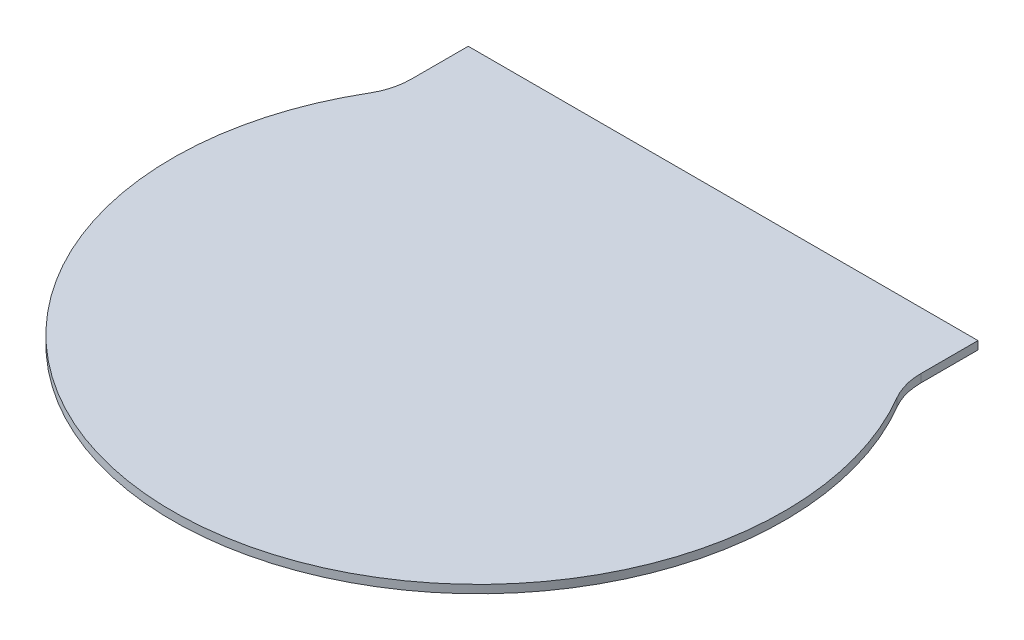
ISO-10303-21;
HEADER;
FILE_DESCRIPTION(('STEP AP214'),'2;1');
FILE_NAME('part.step','',(''),(''),'','','');
FILE_SCHEMA(('AUTOMOTIVE_DESIGN { 1 0 10303 214 1 1 1 1 }'));
ENDSEC;
DATA;
#1=APPLICATION_CONTEXT('core data for automotive mechanical design processes');
#2=APPLICATION_PROTOCOL_DEFINITION('international standard','automotive_design',2000,#1);
#3=PRODUCT_CONTEXT('',#1,'mechanical');
#4=PRODUCT('Part','Part','',(#3));
#5=PRODUCT_RELATED_PRODUCT_CATEGORY('part','',(#4));
#6=PRODUCT_DEFINITION_FORMATION('','',#4);
#7=PRODUCT_DEFINITION_CONTEXT('part definition',#1,'design');
#8=PRODUCT_DEFINITION('design','',#6,#7);
#9=PRODUCT_DEFINITION_SHAPE('','',#8);
#10=(LENGTH_UNIT() NAMED_UNIT(*) SI_UNIT(.MILLI.,.METRE.));
#11=(NAMED_UNIT(*) PLANE_ANGLE_UNIT() SI_UNIT($,.RADIAN.));
#12=(NAMED_UNIT(*) SI_UNIT($,.STERADIAN.) SOLID_ANGLE_UNIT());
#13=UNCERTAINTY_MEASURE_WITH_UNIT(LENGTH_MEASURE(1.E-05),#10,'distance_accuracy_value','');
#14=(GEOMETRIC_REPRESENTATION_CONTEXT(3) GLOBAL_UNCERTAINTY_ASSIGNED_CONTEXT((#13)) GLOBAL_UNIT_ASSIGNED_CONTEXT((#10,
#11,#12)) REPRESENTATION_CONTEXT('',''));
#15=CARTESIAN_POINT('',(0.,0.,0.));
#16=DIRECTION('',(0.,0.,1.));
#17=DIRECTION('',(1.,0.,0.));
#18=AXIS2_PLACEMENT_3D('',#15,#16,#17);
#19=CARTESIAN_POINT('',(3.98779999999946,0.1016,-2.33831798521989));
#20=DIRECTION('',(0.,-1.,0.));
#21=DIRECTION('',(0.,0.,-1.));
#22=AXIS2_PLACEMENT_3D('',#19,#20,#21);
#23=CYLINDRICAL_SURFACE('',#22,0.812799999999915);
#24=CARTESIAN_POINT('',(3.98779999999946,0.,-2.33831798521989));
#25=DIRECTION('',(0.,1.,0.));
#26=DIRECTION('',(0.,0.,1.));
#27=AXIS2_PLACEMENT_3D('',#24,#25,#26);
#28=CIRCLE('',#27,0.812799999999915);
#29=CARTESIAN_POINT('',(3.17499999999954,0.,-2.33831798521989));
#30=VERTEX_POINT('',#29);
#31=CARTESIAN_POINT('',(3.28664835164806,0.,-1.9271851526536));
#32=VERTEX_POINT('',#31);
#33=EDGE_CURVE('E111',#30,#32,#28,.T.);
#34=ORIENTED_EDGE('',*,*,#33,.F.);
#35=DIRECTION('',(0.,-1.,0.));
#36=VECTOR('',#35,1.);
#37=CARTESIAN_POINT('',(3.17499999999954,0.1016,-2.33831798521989));
#38=LINE('',#37,#36);
#39=CARTESIAN_POINT('',(3.17499999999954,0.1016,-2.33831798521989));
#40=VERTEX_POINT('',#39);
#41=EDGE_CURVE('E11',#40,#30,#38,.T.);
#42=ORIENTED_EDGE('',*,*,#41,.F.);
#43=CARTESIAN_POINT('',(3.98779999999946,0.1016,-2.33831798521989));
#44=DIRECTION('',(0.,1.,0.));
#45=DIRECTION('',(0.,0.,1.));
#46=AXIS2_PLACEMENT_3D('',#43,#44,#45);
#47=CIRCLE('',#46,0.812799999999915);
#48=CARTESIAN_POINT('',(3.28664835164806,0.1016,-1.9271851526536));
#49=VERTEX_POINT('',#48);
#50=EDGE_CURVE('E124',#40,#49,#47,.T.);
#51=ORIENTED_EDGE('',*,*,#50,.T.);
#52=DIRECTION('',(0.,-1.,0.));
#53=VECTOR('',#52,1.);
#54=CARTESIAN_POINT('',(3.28664835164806,0.1016,-1.9271851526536));
#55=LINE('',#54,#53);
#56=EDGE_CURVE('E74',#49,#32,#55,.T.);
#57=ORIENTED_EDGE('',*,*,#56,.T.);
#58=EDGE_LOOP('',(#34,#42,#51,#57));
#59=FACE_BOUND('',#58,.T.);
#60=ADVANCED_FACE('F30',(#59),#23,.F.);
#61=CARTESIAN_POINT('',(3.17499999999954,0.1016,0.380999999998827));
#62=DIRECTION('',(-1.,0.,0.));
#63=DIRECTION('',(0.,0.,1.));
#64=AXIS2_PLACEMENT_3D('',#61,#62,#63);
#65=PLANE('',#64);
#66=DIRECTION('',(0.,0.,-1.));
#67=VECTOR('',#66,1.);
#68=CARTESIAN_POINT('',(3.17499999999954,0.,0.380999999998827));
#69=LINE('',#68,#67);
#70=CARTESIAN_POINT('',(3.17499999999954,0.,-3.04800000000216));
#71=VERTEX_POINT('',#70);
#72=EDGE_CURVE('E114',#30,#71,#69,.T.);
#73=ORIENTED_EDGE('',*,*,#72,.T.);
#74=DIRECTION('',(0.,-1.,0.));
#75=VECTOR('',#74,1.);
#76=CARTESIAN_POINT('',(3.17499999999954,0.1016,-3.04800000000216));
#77=LINE('',#76,#75);
#78=CARTESIAN_POINT('',(3.17499999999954,0.1016,-3.04800000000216));
#79=VERTEX_POINT('',#78);
#80=EDGE_CURVE('E38',#79,#71,#77,.T.);
#81=ORIENTED_EDGE('',*,*,#80,.F.);
#82=DIRECTION('',(0.,0.,-1.));
#83=VECTOR('',#82,1.);
#84=CARTESIAN_POINT('',(3.17499999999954,0.1016,0.380999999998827));
#85=LINE('',#84,#83);
#86=EDGE_CURVE('E137',#40,#79,#85,.T.);
#87=ORIENTED_EDGE('',*,*,#86,.F.);
#88=ORIENTED_EDGE('',*,*,#41,.T.);
#89=EDGE_LOOP('',(#73,#81,#87,#88));
#90=FACE_BOUND('',#89,.T.);
#91=ADVANCED_FACE('F140',(#90),#65,.F.);
#92=CARTESIAN_POINT('',(-8.1153426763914,0.1016,-3.04800000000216));
#93=DIRECTION('',(0.,0.,1.));
#94=DIRECTION('',(1.,0.,0.));
#95=AXIS2_PLACEMENT_3D('',#92,#93,#94);
#96=PLANE('',#95);
#97=DIRECTION('',(-1.,0.,0.));
#98=VECTOR('',#97,1.);
#99=CARTESIAN_POINT('',(-8.1153426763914,0.,-3.04800000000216));
#100=LINE('',#99,#98);
#101=CARTESIAN_POINT('',(-3.17499999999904,0.,-3.04800000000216));
#102=VERTEX_POINT('',#101);
#103=EDGE_CURVE('E116',#71,#102,#100,.T.);
#104=ORIENTED_EDGE('',*,*,#103,.T.);
#105=DIRECTION('',(0.,-1.,0.));
#106=VECTOR('',#105,1.);
#107=CARTESIAN_POINT('',(-3.17499999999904,0.1016,-3.04800000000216));
#108=LINE('',#107,#106);
#109=CARTESIAN_POINT('',(-3.17499999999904,0.1016,-3.04800000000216));
#110=VERTEX_POINT('',#109);
#111=EDGE_CURVE('E98',#110,#102,#108,.T.);
#112=ORIENTED_EDGE('',*,*,#111,.F.);
#113=DIRECTION('',(-1.,0.,0.));
#114=VECTOR('',#113,1.);
#115=CARTESIAN_POINT('',(-8.1153426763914,0.1016,-3.04800000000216));
#116=LINE('',#115,#114);
#117=EDGE_CURVE('E103',#79,#110,#116,.T.);
#118=ORIENTED_EDGE('',*,*,#117,.F.);
#119=ORIENTED_EDGE('',*,*,#80,.T.);
#120=EDGE_LOOP('',(#104,#112,#118,#119));
#121=FACE_BOUND('',#120,.T.);
#122=ADVANCED_FACE('F131',(#121),#96,.F.);
#123=CARTESIAN_POINT('',(-3.17499999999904,0.1016,0.380999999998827));
#124=DIRECTION('',(-1.,0.,0.));
#125=DIRECTION('',(0.,0.,1.));
#126=AXIS2_PLACEMENT_3D('',#123,#124,#125);
#127=PLANE('',#126);
#128=DIRECTION('',(0.,0.,-1.));
#129=VECTOR('',#128,1.);
#130=CARTESIAN_POINT('',(-3.17499999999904,0.,0.380999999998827));
#131=LINE('',#130,#129);
#132=CARTESIAN_POINT('',(-3.17499999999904,0.,-2.33831798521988));
#133=VERTEX_POINT('',#132);
#134=EDGE_CURVE('E93',#133,#102,#131,.T.);
#135=ORIENTED_EDGE('',*,*,#134,.F.);
#136=DIRECTION('',(0.,-1.,0.));
#137=VECTOR('',#136,1.);
#138=CARTESIAN_POINT('',(-3.17499999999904,0.1016,-2.33831798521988));
#139=LINE('',#138,#137);
#140=CARTESIAN_POINT('',(-3.17499999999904,0.1016,-2.33831798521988));
#141=VERTEX_POINT('',#140);
#142=EDGE_CURVE('E88',#141,#133,#139,.T.);
#143=ORIENTED_EDGE('',*,*,#142,.F.);
#144=DIRECTION('',(0.,0.,-1.));
#145=VECTOR('',#144,1.);
#146=CARTESIAN_POINT('',(-3.17499999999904,0.1016,0.380999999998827));
#147=LINE('',#146,#145);
#148=EDGE_CURVE('E91',#141,#110,#147,.T.);
#149=ORIENTED_EDGE('',*,*,#148,.T.);
#150=ORIENTED_EDGE('',*,*,#111,.T.);
#151=EDGE_LOOP('',(#135,#143,#149,#150));
#152=FACE_BOUND('',#151,.T.);
#153=ADVANCED_FACE('F90',(#152),#127,.T.);
#154=CARTESIAN_POINT('',(-3.98779999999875,0.1016,-2.33831798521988));
#155=DIRECTION('',(0.,-1.,0.));
#156=DIRECTION('',(0.,0.,-1.));
#157=AXIS2_PLACEMENT_3D('',#154,#155,#156);
#158=CYLINDRICAL_SURFACE('',#157,0.812799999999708);
#159=CARTESIAN_POINT('',(-3.98779999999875,0.,-2.33831798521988));
#160=DIRECTION('',(0.,1.,0.));
#161=DIRECTION('',(0.,0.,1.));
#162=AXIS2_PLACEMENT_3D('',#159,#160,#161);
#163=CIRCLE('',#162,0.812799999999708);
#164=CARTESIAN_POINT('',(-3.28664835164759,0.,-1.9271851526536));
#165=VERTEX_POINT('',#164);
#166=EDGE_CURVE('E120',#165,#133,#163,.T.);
#167=ORIENTED_EDGE('',*,*,#166,.F.);
#168=DIRECTION('',(0.,-1.,0.));
#169=VECTOR('',#168,1.);
#170=CARTESIAN_POINT('',(-3.28664835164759,0.1016,-1.9271851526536));
#171=LINE('',#170,#169);
#172=CARTESIAN_POINT('',(-3.28664835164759,0.1016,-1.9271851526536));
#173=VERTEX_POINT('',#172);
#174=EDGE_CURVE('E67',#173,#165,#171,.T.);
#175=ORIENTED_EDGE('',*,*,#174,.F.);
#176=CARTESIAN_POINT('',(-3.98779999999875,0.1016,-2.33831798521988));
#177=DIRECTION('',(0.,1.,0.));
#178=DIRECTION('',(0.,0.,1.));
#179=AXIS2_PLACEMENT_3D('',#176,#177,#178);
#180=CIRCLE('',#179,0.812799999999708);
#181=EDGE_CURVE('E101',#173,#141,#180,.T.);
#182=ORIENTED_EDGE('',*,*,#181,.T.);
#183=ORIENTED_EDGE('',*,*,#142,.T.);
#184=EDGE_LOOP('',(#167,#175,#182,#183));
#185=FACE_BOUND('',#184,.T.);
#186=ADVANCED_FACE('F106',(#185),#158,.F.);
#187=CARTESIAN_POINT('',(2.37223435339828E-13,0.1016,0.));
#188=DIRECTION('',(0.,-1.,0.));
#189=DIRECTION('',(0.,0.,-1.));
#190=AXIS2_PLACEMENT_3D('',#187,#188,#189);
#191=CYLINDRICAL_SURFACE('',#190,3.80999999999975);
#192=CARTESIAN_POINT('',(2.37223435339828E-13,0.,0.));
#193=DIRECTION('',(0.,1.,0.));
#194=DIRECTION('',(0.,0.,1.));
#195=AXIS2_PLACEMENT_3D('',#192,#193,#194);
#196=CIRCLE('',#195,3.80999999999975);
#197=EDGE_CURVE('E122',#165,#32,#196,.T.);
#198=ORIENTED_EDGE('',*,*,#197,.T.);
#199=ORIENTED_EDGE('',*,*,#56,.F.);
#200=CARTESIAN_POINT('',(2.37223435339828E-13,0.1016,0.));
#201=DIRECTION('',(0.,1.,0.));
#202=DIRECTION('',(0.,0.,1.));
#203=AXIS2_PLACEMENT_3D('',#200,#201,#202);
#204=CIRCLE('',#203,3.80999999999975);
#205=EDGE_CURVE('E46',#173,#49,#204,.T.);
#206=ORIENTED_EDGE('',*,*,#205,.F.);
#207=ORIENTED_EDGE('',*,*,#174,.T.);
#208=EDGE_LOOP('',(#198,#199,#206,#207));
#209=FACE_BOUND('',#208,.T.);
#210=ADVANCED_FACE('F136',(#209),#191,.T.);
#211=CARTESIAN_POINT('',(-8.1153426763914,0.1016,0.380999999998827));
#212=DIRECTION('',(0.,1.,0.));
#213=DIRECTION('',(0.,0.,1.));
#214=AXIS2_PLACEMENT_3D('',#211,#212,#213);
#215=PLANE('',#214);
#216=ORIENTED_EDGE('',*,*,#50,.F.);
#217=ORIENTED_EDGE('',*,*,#86,.T.);
#218=ORIENTED_EDGE('',*,*,#117,.T.);
#219=ORIENTED_EDGE('',*,*,#148,.F.);
#220=ORIENTED_EDGE('',*,*,#181,.F.);
#221=ORIENTED_EDGE('',*,*,#205,.T.);
#222=EDGE_LOOP('',(#216,#217,#218,#219,#220,#221));
#223=FACE_BOUND('',#222,.T.);
#224=ADVANCED_FACE('F100',(#223),#215,.T.);
#225=CARTESIAN_POINT('',(-8.1153426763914,0.,0.380999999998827));
#226=DIRECTION('',(0.,1.,0.));
#227=DIRECTION('',(0.,0.,1.));
#228=AXIS2_PLACEMENT_3D('',#225,#226,#227);
#229=PLANE('',#228);
#230=ORIENTED_EDGE('',*,*,#33,.T.);
#231=ORIENTED_EDGE('',*,*,#197,.F.);
#232=ORIENTED_EDGE('',*,*,#166,.T.);
#233=ORIENTED_EDGE('',*,*,#134,.T.);
#234=ORIENTED_EDGE('',*,*,#103,.F.);
#235=ORIENTED_EDGE('',*,*,#72,.F.);
#236=EDGE_LOOP('',(#230,#231,#232,#233,#234,#235));
#237=FACE_BOUND('',#236,.T.);
#238=ADVANCED_FACE('F135',(#237),#229,.F.);
#239=CLOSED_SHELL('',(#60,#91,#122,#153,#186,#210,#224,#238));
#240=MANIFOLD_SOLID_BREP('B2',#239);
#241=ADVANCED_BREP_SHAPE_REPRESENTATION('',(#18,#240),#14);
#242=SHAPE_DEFINITION_REPRESENTATION(#9,#241);
ENDSEC;
END-ISO-10303-21;
